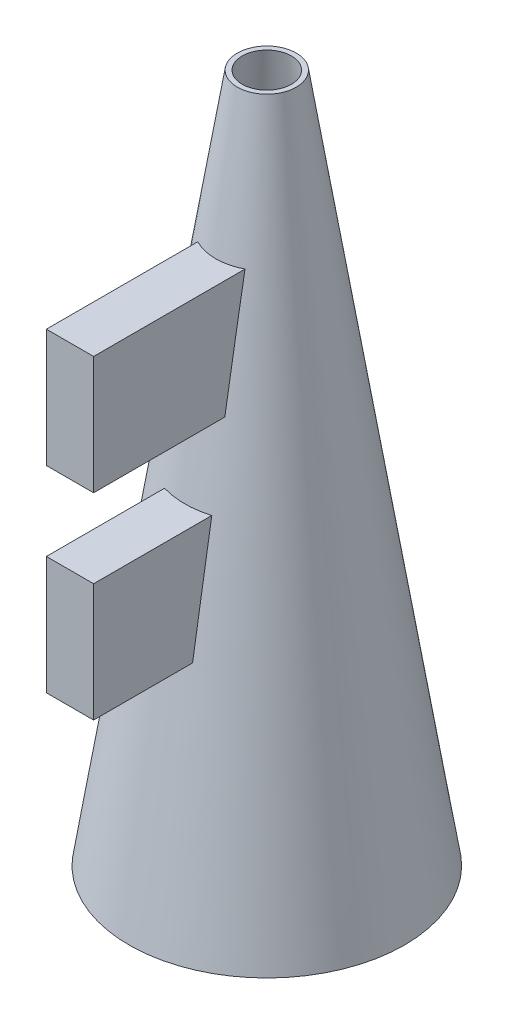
from build123d import *

# Parameters (mm, degrees)
REVOLVE1_ANGLE      = 359.99999999
SKETCH2_W           = 2400
SKETCH2_H           = 6000
BOSS_EXTRUDE1_DEPTH = 10000


with BuildPart() as part:
    # Sketch1 → Revolve1 (revolve)
    with BuildSketch(Plane.XY):
        Polygon((6750, 0), (1250, 35000), (1500, 35000), (7000, 0), align=None)
    revolve(axis=Axis((0, 0, 0), (0, 1, 0)), revolution_arc=REVOLVE1_ANGLE)

    # Sketch2 → Boss-Extrude1 (add)
    with BuildSketch(Plane.XY):
        with Locations((0, 15000)):
            Rectangle(SKETCH2_W, SKETCH2_H)
        with Locations((0, 25000)):
            Rectangle(SKETCH2_W, SKETCH2_H)
    extrude(amount=BOSS_EXTRUDE1_DEPTH)


solid = part.part
